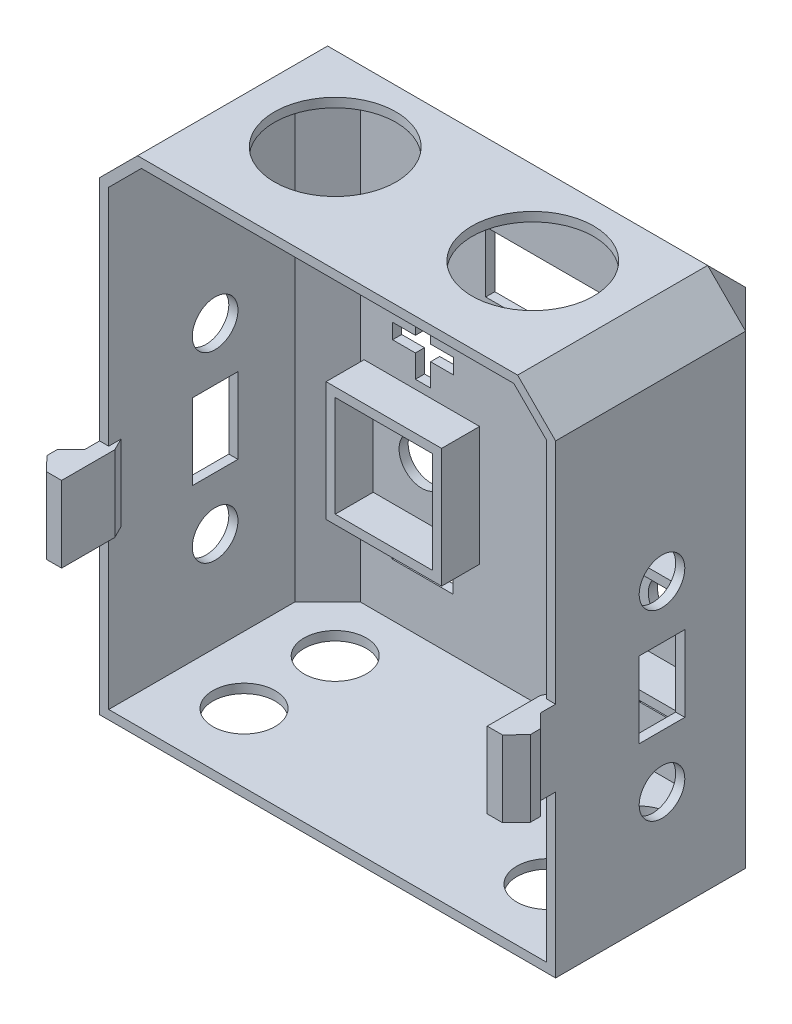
from build123d import *

# Parameters (mm, degrees)
CROQUIS1_W              = 60
CROQUIS1_H              = 80
SALIENTE_EXTRUIR2_DEPTH = 30
CHAFL_N9_SIZE           = 5
VACIADO1_T              = -1.2
CROQUIS2_R              = 8
CORTAR_EXTRUIR1_DEPTH   = 40
CROQUIS3_W              = 6
CROQUIS3_H              = 10
CROQUIS3_R              = 3
CORTAR_EXTRUIR2_DEPTH   = 70
CROQUIS4_R              = 4
CORTAR_EXTRUIR3_DEPTH   = 40
SALIENTE_EXTRUIR3_DEPTH = 5
CROQUIS12_W             = 77.416980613
CROQUIS12_H             = 15
CORTAR_EXTRUIR5_DEPTH   = 78
SALIENTE_EXTRUIR4_DEPTH = 1.2
CROQUIS14_R             = 4.1
CORTAR_EXTRUIR6_DEPTH   = 1.2
CROQUIS15_R             = 3
CORTAR_EXTRUIR7_DEPTH   = 1.2
CROQUIS16_W             = 15.2
CROQUIS16_H             = 15.7
CROQUIS16_W_2           = 12.8
CROQUIS16_H_2           = 13.3
SALIENTE_EXTRUIR5_DEPTH = 5


with BuildPart() as part:
    # Croquis1 → Saliente-Extruir2 (new body)
    with BuildSketch(Plane.XY):
        Rectangle(CROQUIS1_W, CROQUIS1_H)
    extrude(amount=SALIENTE_EXTRUIR2_DEPTH)

    # Chafl_n9
    chafl_n9_edges = [part.edges().sort_by_distance(p)[0] for p in [
        (0, -40, 0),
        (-30, 0, 0),
        (0, 40, 0),
        (30, 0, 0),
        (30, -40, 15),
        (-30, -40, 15),
        (-30, 40, 15),
        (30, 40, 15),
    ]]
    chamfer(chafl_n9_edges, length=CHAFL_N9_SIZE)

    # Vaciado1
    vaciado1_openings = [part.faces().sort_by_distance(p)[0] for p in [
        (0, 0, 30),
    ]]
    offset(amount=VACIADO1_T, openings=vaciado1_openings, kind=Kind.INTERSECTION)

    # Croquis2 → Cortar-Extruir1 (cut)
    with BuildSketch(Plane(origin=(0, 40, 0), x_dir=(1, 0, 0), z_dir=(0, 1, 0))):
        with Locations(Location((-13, -16, 0), (0, 0, 270))):
            Circle(CROQUIS2_R)
        with Locations(Location((13, -16, 0), (0, 0, 90))):
            Circle(CROQUIS2_R)
    extrude(amount=-CORTAR_EXTRUIR1_DEPTH, mode=Mode.SUBTRACT)

    # Croquis3 → Cortar-Extruir2 (cut)
    with BuildSketch(Plane(origin=(30, 0, 0), x_dir=(0, 0, -1), z_dir=(1, 0, 0))):
        with Locations((-16, 0)):
            Rectangle(CROQUIS3_W, CROQUIS3_H)
        with Locations((-16, 12)):
            Circle(CROQUIS3_R)
        with Locations((-16, -12)):
            Circle(CROQUIS3_R)
    extrude(amount=-CORTAR_EXTRUIR2_DEPTH, mode=Mode.SUBTRACT)

    # Croquis4 → Cortar-Extruir3 (cut)
    with BuildSketch(Plane.XZ.offset(40)):
        with Locations(Location((-6, 12, 0), (0, 0, 270))):
            Circle(CROQUIS4_R)
        with Locations(Location((-6, 22, 0), (0, 0, 90))):
            Circle(CROQUIS4_R)
        with Locations(Location((6, 12, 0), (0, 0, 90))):
            Circle(CROQUIS4_R)
        with Locations(Location((6, 22, 0), (0, 0, 270))):
            Circle(CROQUIS4_R)
    extrude(amount=-CORTAR_EXTRUIR3_DEPTH, mode=Mode.SUBTRACT)

    # Croquis8 → Saliente-Extruir3 (add, symmetric)
    with BuildSketch(Plane(origin=(0, 0, 0), x_dir=(1, 0, 0), z_dir=(0, 1, 0))):
        Polygon((-30, -30), (-30, -32), (-31.8, -33.8), (-31.8, -35.126722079), (-30, -37), (-28, -37), (-28, -30), (-30, -26), align=None)
    saliente_extruir3 = extrude(amount=SALIENTE_EXTRUIR3_DEPTH, both=True)

    # Simetr_a1: Saliente-Extruir3 across plane
    add(saliente_extruir3.mirror(Plane(origin=(0, 0, 0), x_dir=(0, 0, 1), z_dir=(1, 0, 0))))

    # Croquis12 → Cortar-Extruir5 (cut)
    with BuildSketch(Plane.XY.offset(30)):
        with Locations((3.665985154, -32.5)):
            Rectangle(CROQUIS12_W, CROQUIS12_H)
    extrude(amount=-CORTAR_EXTRUIR5_DEPTH, mode=Mode.SUBTRACT)

    # Croquis13 → Saliente-Extruir4 (add)
    with BuildSketch(Plane.XZ.offset(25)):
        Polygon((-28.8, 30), (28.8, 30), (30, 30), (30, 5), (25, 0), (-25, 0), (-30, 5), (-30, 30), align=None)
    extrude(amount=SALIENTE_EXTRUIR4_DEPTH)

    # Croquis14 → Cortar-Extruir6 (cut)
    with BuildSketch(Plane.XZ.offset(26.2)):
        with Locations(Location((-20, 9, 0), (0, 0, 270))):
            Circle(CROQUIS14_R)
        with Locations(Location((-20, 21, 0), (0, 0, 90))):
            Circle(CROQUIS14_R)
        with Locations(Location((20, 9, 0), (0, 0, 90))):
            Circle(CROQUIS14_R)
        with Locations(Location((20, 21, 0), (0, 0, 270))):
            Circle(CROQUIS14_R)
    extrude(amount=-CORTAR_EXTRUIR6_DEPTH, mode=Mode.SUBTRACT)

    # Croquis15 → Cortar-Extruir7 (cut)
    with BuildSketch(Plane(origin=(0, 0, 0), x_dir=(-1, 0, 0), z_dir=(0, 0, -1))):
        with Locations((-16.4, -5)):
            Circle(CROQUIS15_R)
        with Locations(Location((16.4, -5, 0), (0, 0, 180))):
            Circle(CROQUIS15_R)
        Polygon((-17.324109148, -16.01778978), (-15.324109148, -16.01778978), (-12.324109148, -16.01778978), (-12.324109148, -18.01778978), (-15.324109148, -18.01778978), (-17.324109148, -18.01778978), (-20.324109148, -18.01778978), (-20.324109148, -16.01778978), align=None)
        Polygon((-17.4, 9), (-17.4, 12), (-15.4, 12), (-15.4, 9), (-12.4, 9), (-12.4, 7), (-15.4, 7), (-15.4, 4), (-17.4, 4), (-17.4, 7), (-20.4, 7), (-20.4, 9), align=None)
        Polygon((17.324109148, -18.01778978), (20.324109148, -18.01778978), (20.324109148, -16.01778978), (17.324109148, -16.01778978), (15.324109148, -16.01778978), (12.324109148, -16.01778978), (12.324109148, -18.01778978), (15.324109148, -18.01778978), align=None)
        Polygon((15.248218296, 7), (15.248218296, 4), (17.248218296, 4), (17.248218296, 7), (20.248218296, 7), (20.248218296, 9), (17.248218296, 9), (17.248218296, 12), (15.248218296, 12), (15.248218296, 9), (12.248218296, 9), (12.248218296, 7), align=None)
        Polygon((0, 26), (8, 26), (8, 18), (-8, 18), (-8, 26), align=None)
    extrude(amount=-CORTAR_EXTRUIR7_DEPTH, mode=Mode.SUBTRACT)

    # Croquis16 → Saliente-Extruir5 (add)
    with BuildSketch(Plane.XY.offset(1.2)):
        with Locations((16.4, -5)):
            Rectangle(CROQUIS16_W, CROQUIS16_H)
        with Locations((16.4, -5)):
            Rectangle(CROQUIS16_W_2, CROQUIS16_H_2, mode=Mode.SUBTRACT)
    saliente_extruir5 = extrude(amount=SALIENTE_EXTRUIR5_DEPTH)

    # Simetr_a2: Saliente-Extruir5 across plane
    add(saliente_extruir5.mirror(Plane(origin=(0, 0, 0), x_dir=(0, 0, 1), z_dir=(1, 0, 0))))


solid = part.part
